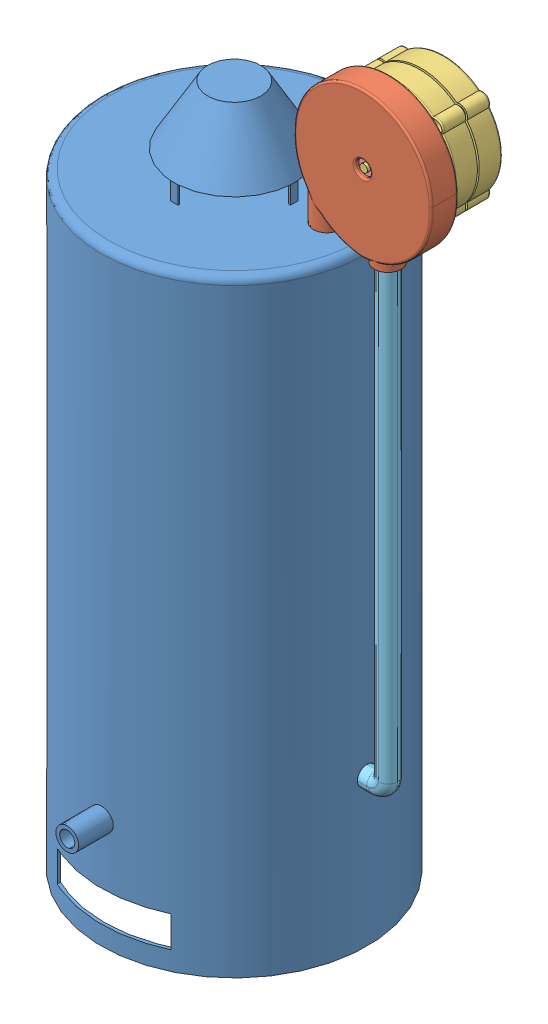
SolidWorks assembly caldera con generador.SLDASM, configuration Default (file format 8000). Lengths in mm.
Overall size (452.24 991.67 395).
5 component instances, 5 part files, 9 mates.
Components (placement in the parent):
- Caldera-1: Caldera.SLDPRT [Default] at (230.4192 368.1811 713.1365) size (368.88 899.9 395)
- carcaza-1: carcaza.SLDPRT [Default] at (393.441 948.2558 700.4365) x (1 0 0) z (0 -1 0) size (180.68 35.85 196.85)
- Generador-1: Generador.SLDPRT [Default] at (393.441 948.2558 622.9665) x (1 0 0) z (0 -1 0) size (152.4 115.57 152.4)
- Turbina-1: Turbina.SLDPRT [Default] at (393.441 948.2558 700.4365) x (1 0 0) z (0 -1 0) size (152.4 25.4 152.4)
- tubo-1: tubo.SLDPRT [Default] at (732.257 903.6439 700.4365) size (40.13 624.9 25.4)
Mates (geometry in assembly coordinates):
- Concentric1: concentric: cylinder of Generador-1 through (393.441 948.2558 729.6465) axis (0 0 -1) radius 5.08; cylinder of Turbina-1 through (393.441 948.2558 725.8365) axis (0 0 -1) radius 5.08
- Concentric2: concentric: circle of carcaza-1; circle of Turbina-1
- Concentric3: concentric: circle of carcaza-1; circle of Turbina-1
- Coincident2: coincident: plane of carcaza-1 through (393.441 942.5408 725.8365) normal (0 0 -1); plane of Turbina-1 through (393.441 948.2558 725.8365) normal (0 0 1)
- Coincident3: coincident: plane of carcaza-1 through (393.441 942.5408 695.3565) normal (0 0 -1); circle of Generador-1
- Concentric4: concentric: circle of Caldera-1; circle of carcaza-1
- Coincident4: coincident: plane of Caldera-1 through (230.4192 846.6558 713.1365) normal (0 1 0); circle of carcaza-1
- Concentric5: concentric: cylinder of carcaza-1 through (408.958 866.2138 713.1365) axis (0 -1 0) radius 12.7261; circle of tubo-1
- Concentric6: concentric: cylinder of Caldera-1 through (400.4192 241.7151 713.1365) axis (-1 0 0) radius 7; cylinder of tubo-1 through (393.718 241.7151 713.1365) axis (-1 0 0) radius 12.7
